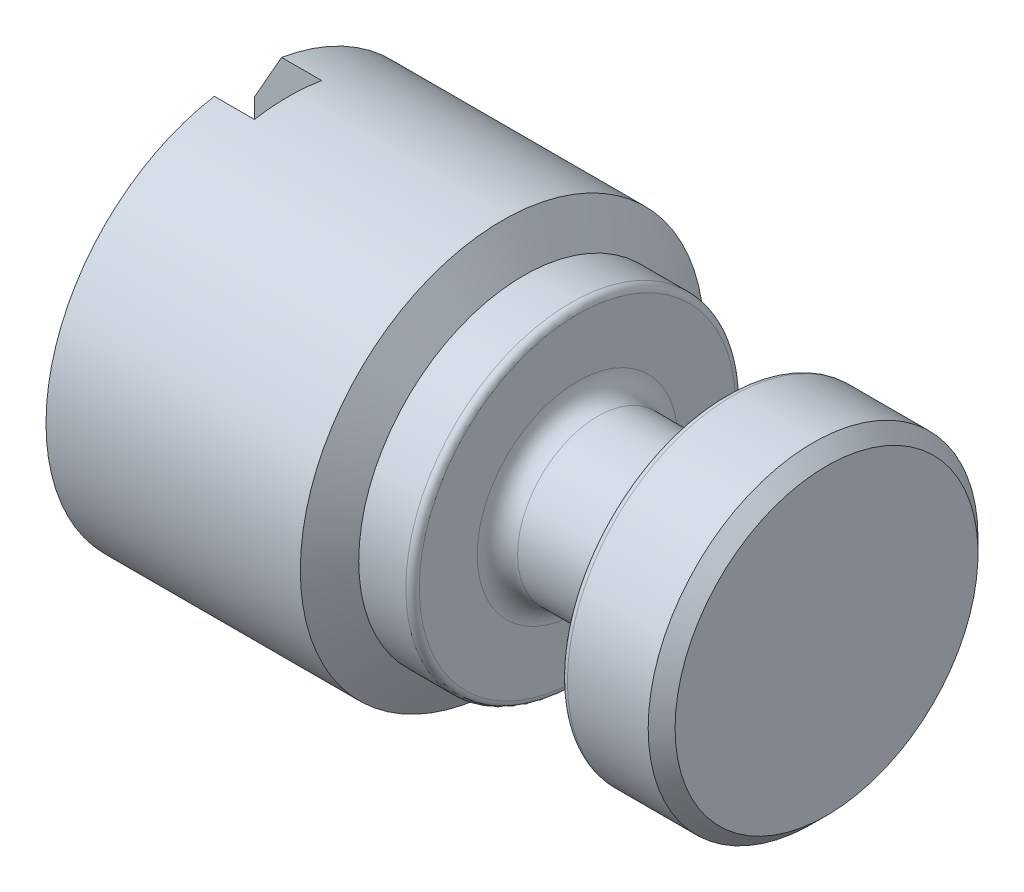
ISO-10303-21;
HEADER;
FILE_DESCRIPTION(('STEP AP214'),'2;1');
FILE_NAME('part.step','',(''),(''),'','','');
FILE_SCHEMA(('AUTOMOTIVE_DESIGN { 1 0 10303 214 1 1 1 1 }'));
ENDSEC;
DATA;
#1=APPLICATION_CONTEXT('core data for automotive mechanical design processes');
#2=APPLICATION_PROTOCOL_DEFINITION('international standard','automotive_design',2000,#1);
#3=PRODUCT_CONTEXT('',#1,'mechanical');
#4=PRODUCT('Part','Part','',(#3));
#5=PRODUCT_RELATED_PRODUCT_CATEGORY('part','',(#4));
#6=PRODUCT_DEFINITION_FORMATION('','',#4);
#7=PRODUCT_DEFINITION_CONTEXT('part definition',#1,'design');
#8=PRODUCT_DEFINITION('design','',#6,#7);
#9=PRODUCT_DEFINITION_SHAPE('','',#8);
#10=(LENGTH_UNIT() NAMED_UNIT(*) SI_UNIT(.MILLI.,.METRE.));
#11=(NAMED_UNIT(*) PLANE_ANGLE_UNIT() SI_UNIT($,.RADIAN.));
#12=(NAMED_UNIT(*) SI_UNIT($,.STERADIAN.) SOLID_ANGLE_UNIT());
#13=UNCERTAINTY_MEASURE_WITH_UNIT(LENGTH_MEASURE(1.E-05),#10,'distance_accuracy_value','');
#14=(GEOMETRIC_REPRESENTATION_CONTEXT(3) GLOBAL_UNCERTAINTY_ASSIGNED_CONTEXT((#13)) GLOBAL_UNIT_ASSIGNED_CONTEXT((#10,
#11,#12)) REPRESENTATION_CONTEXT('',''));
#15=CARTESIAN_POINT('',(0.,0.,0.));
#16=DIRECTION('',(0.,0.,1.));
#17=DIRECTION('',(1.,0.,0.));
#18=AXIS2_PLACEMENT_3D('',#15,#16,#17);
#19=CARTESIAN_POINT('',(0.40414518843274,0.,0.));
#20=DIRECTION('',(1.,0.,0.));
#21=DIRECTION('',(0.,0.,-1.));
#22=AXIS2_PLACEMENT_3D('',#19,#20,#21);
#23=CONICAL_SURFACE('',#22,3.,1.0471975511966);
#24=CARTESIAN_POINT('',(0.40414518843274,0.,0.));
#25=DIRECTION('',(-1.,0.,0.));
#26=DIRECTION('',(0.,0.,1.));
#27=AXIS2_PLACEMENT_3D('',#24,#25,#26);
#28=CIRCLE('',#27,3.);
#29=CARTESIAN_POINT('',(0.40414518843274,2.95803989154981,-0.499999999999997));
#30=VERTEX_POINT('',#29);
#31=CARTESIAN_POINT('',(0.40414518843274,-2.95803989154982,-0.500000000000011));
#32=VERTEX_POINT('',#31);
#33=EDGE_CURVE('E143',#30,#32,#28,.T.);
#34=ORIENTED_EDGE('',*,*,#33,.T.);
#35=CARTESIAN_POINT('',(2.4983365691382,-6.60835742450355,-0.499999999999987));
#36=CARTESIAN_POINT('',(2.33754994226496,-6.32905650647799,-0.499999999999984));
#37=CARTESIAN_POINT('',(2.17679546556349,-6.0497370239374,-0.499999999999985));
#38=CARTESIAN_POINT('',(1.85541884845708,-5.49101933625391,-0.499999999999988));
#39=CARTESIAN_POINT('',(1.69479670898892,-5.21162113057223,-0.49999999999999));
#40=CARTESIAN_POINT('',(1.37362738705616,-4.65248605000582,-0.499999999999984));
#41=CARTESIAN_POINT('',(1.21308036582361,-4.37274908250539,-0.499999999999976));
#42=CARTESIAN_POINT('',(0.892332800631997,-3.81307851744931,-0.499999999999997));
#43=CARTESIAN_POINT('',(0.732132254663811,-3.53314492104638,-0.500000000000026));
#44=CARTESIAN_POINT('',(0.492929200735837,-3.11396046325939,-0.500000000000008));
#45=CARTESIAN_POINT('',(0.413665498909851,-2.97485868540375,-0.499999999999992));
#46=CARTESIAN_POINT('',(0.255397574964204,-2.69650513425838,-0.499999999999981));
#47=CARTESIAN_POINT('',(0.176393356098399,-2.55725335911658,-0.499999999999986));
#48=CARTESIAN_POINT('',(0.0188328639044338,-2.27857581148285,-0.499999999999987));
#49=CARTESIAN_POINT('',(-0.0597235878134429,-2.13915013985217,-0.499999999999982));
#50=CARTESIAN_POINT('',(-0.216137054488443,-1.85991156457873,-0.499999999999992));
#51=CARTESIAN_POINT('',(-0.293994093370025,-1.72009867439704,-0.500000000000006));
#52=CARTESIAN_POINT('',(-0.409961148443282,-1.50940543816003,-0.499999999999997));
#53=CARTESIAN_POINT('',(-0.448588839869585,-1.43881034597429,-0.499999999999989));
#54=CARTESIAN_POINT('',(-0.525315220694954,-1.29732475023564,-0.499999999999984));
#55=CARTESIAN_POINT('',(-0.563413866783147,-1.22643422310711,-0.499999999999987));
#56=CARTESIAN_POINT('',(-0.638817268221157,-1.08412531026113,-0.499999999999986));
#57=CARTESIAN_POINT('',(-0.676121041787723,-1.0127064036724,-0.499999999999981));
#58=CARTESIAN_POINT('',(-0.749323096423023,-0.869156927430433,-0.499999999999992));
#59=CARTESIAN_POINT('',(-0.785221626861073,-0.797026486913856,-0.500000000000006));
#60=CARTESIAN_POINT('',(-0.837549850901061,-0.686867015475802,-0.499999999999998));
#61=CARTESIAN_POINT('',(-0.854960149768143,-0.64930666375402,-0.499999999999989));
#62=CARTESIAN_POINT('',(-0.888745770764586,-0.573725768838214,-0.499999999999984));
#63=CARTESIAN_POINT('',(-0.905121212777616,-0.535705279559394,-0.499999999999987));
#64=CARTESIAN_POINT('',(-0.936339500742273,-0.459031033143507,-0.499999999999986));
#65=CARTESIAN_POINT('',(-0.951182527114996,-0.420377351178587,-0.499999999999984));
#66=CARTESIAN_POINT('',(-0.978536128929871,-0.342270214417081,-0.49999999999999));
#67=CARTESIAN_POINT('',(-0.991047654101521,-0.302817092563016,-0.499999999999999));
#68=CARTESIAN_POINT('',(-1.01648208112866,-0.208025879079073,-0.500000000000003));
#69=CARTESIAN_POINT('',(-1.02784152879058,-0.152215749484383,-0.499999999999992));
#70=CARTESIAN_POINT('',(-1.03702258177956,-0.0678306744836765,-0.499999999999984));
#71=CARTESIAN_POINT('',(-1.03878028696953,-0.0396852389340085,-0.499999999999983));
#72=CARTESIAN_POINT('',(-1.03952744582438,0.0166440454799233,-0.49999999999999));
#73=CARTESIAN_POINT('',(-1.03851695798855,0.0448278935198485,-0.499999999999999));
#74=CARTESIAN_POINT('',(-1.03321049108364,0.108525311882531,-0.500000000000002));
#75=CARTESIAN_POINT('',(-1.02810354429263,0.14397033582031,-0.49999999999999));
#76=CARTESIAN_POINT('',(-1.01444226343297,0.214196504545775,-0.499999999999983));
#77=CARTESIAN_POINT('',(-1.00588391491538,0.248976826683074,-0.499999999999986));
#78=CARTESIAN_POINT('',(-0.986157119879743,0.318273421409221,-0.499999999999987));
#79=CARTESIAN_POINT('',(-0.974955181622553,0.352779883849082,-0.499999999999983));
#80=CARTESIAN_POINT('',(-0.950795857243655,0.421147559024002,-0.49999999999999));
#81=CARTESIAN_POINT('',(-0.937839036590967,0.455008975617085,-0.5));
#82=CARTESIAN_POINT('',(-0.909399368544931,0.525488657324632,-0.500000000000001));
#83=CARTESIAN_POINT('',(-0.893793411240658,0.562056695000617,-0.499999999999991));
#84=CARTESIAN_POINT('',(-0.861582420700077,0.634752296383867,-0.499999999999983));
#85=CARTESIAN_POINT('',(-0.844977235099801,0.670879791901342,-0.499999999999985));
#86=CARTESIAN_POINT('',(-0.794117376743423,0.778807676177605,-0.499999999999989));
#87=CARTESIAN_POINT('',(-0.758832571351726,0.850120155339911,-0.499999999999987));
#88=CARTESIAN_POINT('',(-0.686767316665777,0.992116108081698,-0.499999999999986));
#89=CARTESIAN_POINT('',(-0.649984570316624,1.06279839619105,-0.499999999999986));
#90=CARTESIAN_POINT('',(-0.57556503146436,1.20368457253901,-0.499999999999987));
#91=CARTESIAN_POINT('',(-0.537928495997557,1.27388859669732,-0.499999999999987));
#92=CARTESIAN_POINT('',(-0.462314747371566,1.41362256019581,-0.499999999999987));
#93=CARTESIAN_POINT('',(-0.424340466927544,1.48315409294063,-0.499999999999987));
#94=CARTESIAN_POINT('',(-0.348023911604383,1.62202162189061,-0.499999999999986));
#95=CARTESIAN_POINT('',(-0.309681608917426,1.69135760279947,-0.499999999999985));
#96=CARTESIAN_POINT('',(-0.194352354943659,1.8990197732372,-0.499999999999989));
#97=CARTESIAN_POINT('',(-0.116988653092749,2.03713648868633,-0.499999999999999));
#98=CARTESIAN_POINT('',(0.064775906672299,2.3601671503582,-0.500000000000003));
#99=CARTESIAN_POINT('',(0.169390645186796,2.54496043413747,-0.499999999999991));
#100=CARTESIAN_POINT('',(0.379124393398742,2.91426301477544,-0.499999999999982));
#101=CARTESIAN_POINT('',(0.484243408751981,3.09877230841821,-0.499999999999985));
#102=CARTESIAN_POINT('',(0.800118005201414,3.65220737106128,-0.49999999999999));
#103=CARTESIAN_POINT('',(1.01130433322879,4.02088713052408,-0.499999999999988));
#104=CARTESIAN_POINT('',(1.43503208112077,4.75953035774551,-0.499999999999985));
#105=CARTESIAN_POINT('',(1.647575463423,5.12949269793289,-0.499999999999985));
#106=CARTESIAN_POINT('',(2.07284454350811,5.86909697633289,-0.499999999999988));
#107=CARTESIAN_POINT('',(2.28557012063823,6.23873898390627,-0.499999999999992));
#108=CARTESIAN_POINT('',(2.49833656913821,6.60835742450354,-0.5));
#109=B_SPLINE_CURVE_WITH_KNOTS('',3,(#35,#36,#37,#38,#39,#40,#41,#42,#43,#44,#45,#46,#47,#48,
#49,#50,#51,#52,#53,#54,#55,#56,#57,#58,#59,#60,#61,#62,#63,#64,#65,#66,#67,#68,#69,#70,#71,#72,
#73,#74,#75,#76,#77,#78,#79,#80,#81,#82,#83,#84,#85,#86,#87,#88,#89,#90,#91,#92,#93,#94,#95,#96,
#97,#98,#99,#100,#101,#102,#103,#104,#105,#106,#107,#108),.UNSPECIFIED.,.F.,.F.,(4,2,2,2,2,2,2,
2,2,2,2,2,2,2,2,2,2,2,2,2,2,2,2,2,2,2,2,2,2,2,2,2,2,2,2,2,4),(0.,0.966825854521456,
1.93365849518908,2.90126013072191,3.86885614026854,4.3491562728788,4.82946240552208,
5.30956152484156,5.7896441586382,6.03105935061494,6.27249419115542,6.51421172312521,
6.75588616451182,6.88007299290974,7.00424540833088,7.12840318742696,7.25251028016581,
7.42257675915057,7.50705075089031,7.59152295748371,7.69872713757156,7.80605637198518,
7.91482621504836,8.02356109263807,8.14281580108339,8.26208873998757,8.50074311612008,
8.73977836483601,8.97874258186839,9.21641780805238,9.45411113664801,9.92903195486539,
10.5660826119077,11.2031404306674,12.477784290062,13.7577926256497,15.0372402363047),.UNSPECIFIED.);
#110=CARTESIAN_POINT('',(0.,-2.24499443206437,-0.5));
#111=VERTEX_POINT('',#110);
#112=EDGE_CURVE('E86',#32,#111,#109,.T.);
#113=ORIENTED_EDGE('',*,*,#112,.T.);
#114=CARTESIAN_POINT('',(0.,0.,0.));
#115=DIRECTION('',(-1.,0.,0.));
#116=DIRECTION('',(0.,0.,1.));
#117=AXIS2_PLACEMENT_3D('',#114,#115,#116);
#118=CIRCLE('',#117,2.3);
#119=CARTESIAN_POINT('',(0.,2.24499443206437,-0.5));
#120=VERTEX_POINT('',#119);
#121=EDGE_CURVE('E135',#120,#111,#118,.T.);
#122=ORIENTED_EDGE('',*,*,#121,.F.);
#123=EDGE_CURVE('E284',#120,#30,#109,.T.);
#124=ORIENTED_EDGE('',*,*,#123,.T.);
#125=EDGE_LOOP('',(#34,#113,#122,#124));
#126=FACE_BOUND('',#125,.T.);
#127=ADVANCED_FACE('F63',(#126),#23,.T.);
#128=CARTESIAN_POINT('',(0.,2.3,0.));
#129=DIRECTION('',(1.,0.,0.));
#130=DIRECTION('',(0.,0.,-1.));
#131=AXIS2_PLACEMENT_3D('',#128,#129,#130);
#132=PLANE('',#131);
#133=ORIENTED_EDGE('',*,*,#121,.T.);
#134=DIRECTION('',(0.,1.,0.));
#135=VECTOR('',#134,1.);
#136=CARTESIAN_POINT('',(0.,2.3,-0.5));
#137=LINE('',#136,#135);
#138=EDGE_CURVE('E122',#111,#120,#137,.T.);
#139=ORIENTED_EDGE('',*,*,#138,.T.);
#140=EDGE_LOOP('',(#133,#139));
#141=FACE_BOUND('',#140,.T.);
#142=ADVANCED_FACE('F193',(#141),#132,.F.);
#143=CARTESIAN_POINT('',(9.,0.,0.));
#144=DIRECTION('',(-1.,0.,0.));
#145=DIRECTION('',(0.,0.,1.));
#146=AXIS2_PLACEMENT_3D('',#143,#144,#145);
#147=PLANE('',#146);
#148=CARTESIAN_POINT('',(9.,0.,0.));
#149=DIRECTION('',(-1.,0.,0.));
#150=DIRECTION('',(0.,0.,1.));
#151=AXIS2_PLACEMENT_3D('',#148,#149,#150);
#152=CIRCLE('',#151,2.25);
#153=CARTESIAN_POINT('',(9.,0.,2.25));
#154=VERTEX_POINT('',#153);
#155=EDGE_CURVE('E153',#154,#154,#152,.F.);
#156=ORIENTED_EDGE('',*,*,#155,.T.);
#157=EDGE_LOOP('',(#156));
#158=FACE_BOUND('',#157,.T.);
#159=ADVANCED_FACE('F199',(#158),#147,.F.);
#160=CARTESIAN_POINT('',(-5.4550241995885,0.,0.));
#161=DIRECTION('',(-1.,0.,0.));
#162=DIRECTION('',(0.,0.,1.));
#163=AXIS2_PLACEMENT_3D('',#160,#161,#162);
#164=CYLINDRICAL_SURFACE('',#163,2.45);
#165=CARTESIAN_POINT('',(7.6,0.,0.));
#166=DIRECTION('',(1.,0.,0.));
#167=DIRECTION('',(0.,0.,-1.));
#168=AXIS2_PLACEMENT_3D('',#165,#166,#167);
#169=CIRCLE('',#168,2.45);
#170=CARTESIAN_POINT('',(7.6,0.,-2.45));
#171=VERTEX_POINT('',#170);
#172=EDGE_CURVE('E12',#171,#171,#169,.T.);
#173=ORIENTED_EDGE('',*,*,#172,.T.);
#174=EDGE_LOOP('',(#173));
#175=FACE_BOUND('',#174,.T.);
#176=CARTESIAN_POINT('',(8.8,0.,0.));
#177=DIRECTION('',(-1.,0.,0.));
#178=DIRECTION('',(0.,0.,1.));
#179=AXIS2_PLACEMENT_3D('',#176,#177,#178);
#180=CIRCLE('',#179,2.45);
#181=CARTESIAN_POINT('',(8.8,0.,2.45000000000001));
#182=VERTEX_POINT('',#181);
#183=EDGE_CURVE('E150',#182,#182,#180,.T.);
#184=ORIENTED_EDGE('',*,*,#183,.T.);
#185=EDGE_LOOP('',(#184));
#186=FACE_BOUND('',#185,.T.);
#187=ADVANCED_FACE('F236',(#175,#186),#164,.T.);
#188=CARTESIAN_POINT('',(7.50000000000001,2.45000000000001,0.));
#189=DIRECTION('',(1.,0.,0.));
#190=DIRECTION('',(0.,0.,-1.));
#191=AXIS2_PLACEMENT_3D('',#188,#189,#190);
#192=PLANE('',#191);
#193=CARTESIAN_POINT('',(7.5,0.,0.));
#194=DIRECTION('',(1.,0.,0.));
#195=DIRECTION('',(0.,0.,-1.));
#196=AXIS2_PLACEMENT_3D('',#193,#194,#195);
#197=CIRCLE('',#196,2.35);
#198=CARTESIAN_POINT('',(7.5,0.,-2.35));
#199=VERTEX_POINT('',#198);
#200=EDGE_CURVE('E71',#199,#199,#197,.F.);
#201=ORIENTED_EDGE('',*,*,#200,.T.);
#202=EDGE_LOOP('',(#201));
#203=FACE_BOUND('',#202,.T.);
#204=CARTESIAN_POINT('',(7.5,0.,0.));
#205=DIRECTION('',(1.,0.,0.));
#206=DIRECTION('',(0.,0.,-1.));
#207=AXIS2_PLACEMENT_3D('',#204,#205,#206);
#208=CIRCLE('',#207,1.49);
#209=CARTESIAN_POINT('',(7.5,0.,-1.49));
#210=VERTEX_POINT('',#209);
#211=EDGE_CURVE('E123',#210,#210,#208,.T.);
#212=ORIENTED_EDGE('',*,*,#211,.T.);
#213=EDGE_LOOP('',(#212));
#214=FACE_BOUND('',#213,.T.);
#215=ADVANCED_FACE('F181',(#203,#214),#192,.F.);
#216=CARTESIAN_POINT('',(-5.4550241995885,0.,0.));
#217=DIRECTION('',(-1.,0.,0.));
#218=DIRECTION('',(0.,0.,1.));
#219=AXIS2_PLACEMENT_3D('',#216,#217,#218);
#220=CYLINDRICAL_SURFACE('',#219,1.19);
#221=CARTESIAN_POINT('',(5.6,0.,0.));
#222=DIRECTION('',(-1.,0.,0.));
#223=DIRECTION('',(0.,0.,1.));
#224=AXIS2_PLACEMENT_3D('',#221,#222,#223);
#225=CIRCLE('',#224,1.19);
#226=CARTESIAN_POINT('',(5.6,0.,1.19000000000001));
#227=VERTEX_POINT('',#226);
#228=EDGE_CURVE('E162',#227,#227,#225,.F.);
#229=ORIENTED_EDGE('',*,*,#228,.T.);
#230=EDGE_LOOP('',(#229));
#231=FACE_BOUND('',#230,.T.);
#232=CARTESIAN_POINT('',(7.2,0.,0.));
#233=DIRECTION('',(1.,0.,0.));
#234=DIRECTION('',(0.,0.,-1.));
#235=AXIS2_PLACEMENT_3D('',#232,#233,#234);
#236=CIRCLE('',#235,1.19);
#237=CARTESIAN_POINT('',(7.2,0.,-1.19));
#238=VERTEX_POINT('',#237);
#239=EDGE_CURVE('E159',#238,#238,#236,.F.);
#240=ORIENTED_EDGE('',*,*,#239,.T.);
#241=EDGE_LOOP('',(#240));
#242=FACE_BOUND('',#241,.T.);
#243=ADVANCED_FACE('F229',(#231,#242),#220,.T.);
#244=CARTESIAN_POINT('',(5.3,1.19,0.));
#245=DIRECTION('',(-1.,0.,0.));
#246=DIRECTION('',(0.,0.,1.));
#247=AXIS2_PLACEMENT_3D('',#244,#245,#246);
#248=PLANE('',#247);
#249=CARTESIAN_POINT('',(5.3,0.,0.));
#250=DIRECTION('',(-1.,0.,0.));
#251=DIRECTION('',(0.,0.,1.));
#252=AXIS2_PLACEMENT_3D('',#249,#250,#251);
#253=CIRCLE('',#252,2.35);
#254=CARTESIAN_POINT('',(5.3,0.,2.35000000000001));
#255=VERTEX_POINT('',#254);
#256=EDGE_CURVE('E176',#255,#255,#253,.F.);
#257=ORIENTED_EDGE('',*,*,#256,.T.);
#258=EDGE_LOOP('',(#257));
#259=FACE_BOUND('',#258,.T.);
#260=CARTESIAN_POINT('',(5.3,0.,0.));
#261=DIRECTION('',(-1.,0.,0.));
#262=DIRECTION('',(0.,0.,1.));
#263=AXIS2_PLACEMENT_3D('',#260,#261,#262);
#264=CIRCLE('',#263,1.49);
#265=CARTESIAN_POINT('',(5.3,0.,1.49000000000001));
#266=VERTEX_POINT('',#265);
#267=EDGE_CURVE('E156',#266,#266,#264,.T.);
#268=ORIENTED_EDGE('',*,*,#267,.T.);
#269=EDGE_LOOP('',(#268));
#270=FACE_BOUND('',#269,.T.);
#271=ADVANCED_FACE('F225',(#259,#270),#248,.F.);
#272=CARTESIAN_POINT('',(-5.4550241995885,0.,0.));
#273=DIRECTION('',(-1.,0.,0.));
#274=DIRECTION('',(0.,0.,1.));
#275=AXIS2_PLACEMENT_3D('',#272,#273,#274);
#276=CYLINDRICAL_SURFACE('',#275,2.45);
#277=CARTESIAN_POINT('',(5.2,0.,0.));
#278=DIRECTION('',(-1.,0.,0.));
#279=DIRECTION('',(0.,0.,1.));
#280=AXIS2_PLACEMENT_3D('',#277,#278,#279);
#281=CIRCLE('',#280,2.45);
#282=CARTESIAN_POINT('',(5.2,0.,2.45000000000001));
#283=VERTEX_POINT('',#282);
#284=EDGE_CURVE('E173',#283,#283,#281,.T.);
#285=ORIENTED_EDGE('',*,*,#284,.T.);
#286=EDGE_LOOP('',(#285));
#287=FACE_BOUND('',#286,.T.);
#288=CARTESIAN_POINT('',(4.5,0.,0.));
#289=DIRECTION('',(-1.,0.,0.));
#290=DIRECTION('',(0.,0.,1.));
#291=AXIS2_PLACEMENT_3D('',#288,#289,#290);
#292=CIRCLE('',#291,2.45);
#293=CARTESIAN_POINT('',(4.5,0.,2.45000000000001));
#294=VERTEX_POINT('',#293);
#295=EDGE_CURVE('E147',#294,#294,#292,.T.);
#296=ORIENTED_EDGE('',*,*,#295,.F.);
#297=EDGE_LOOP('',(#296));
#298=FACE_BOUND('',#297,.T.);
#299=ADVANCED_FACE('F217',(#287,#298),#276,.T.);
#300=CARTESIAN_POINT('',(4.5,0.,0.));
#301=DIRECTION('',(-1.,0.,0.));
#302=DIRECTION('',(0.,0.,1.));
#303=AXIS2_PLACEMENT_3D('',#300,#301,#302);
#304=CONICAL_SURFACE('',#303,2.45,1.0471975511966);
#305=CARTESIAN_POINT('',(4.18245735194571,0.,0.));
#306=DIRECTION('',(-1.,0.,0.));
#307=DIRECTION('',(0.,0.,1.));
#308=AXIS2_PLACEMENT_3D('',#305,#306,#307);
#309=CIRCLE('',#308,3.);
#310=CARTESIAN_POINT('',(4.18245735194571,0.,3.00000000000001));
#311=VERTEX_POINT('',#310);
#312=EDGE_CURVE('E144',#311,#311,#309,.T.);
#313=ORIENTED_EDGE('',*,*,#312,.F.);
#314=EDGE_LOOP('',(#313));
#315=FACE_BOUND('',#314,.T.);
#316=ORIENTED_EDGE('',*,*,#295,.T.);
#317=EDGE_LOOP('',(#316));
#318=FACE_BOUND('',#317,.T.);
#319=ADVANCED_FACE('F212',(#315,#318),#304,.T.);
#320=CARTESIAN_POINT('',(-5.4550241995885,0.,0.));
#321=DIRECTION('',(-1.,0.,0.));
#322=DIRECTION('',(0.,0.,1.));
#323=AXIS2_PLACEMENT_3D('',#320,#321,#322);
#324=CYLINDRICAL_SURFACE('',#323,3.);
#325=ORIENTED_EDGE('',*,*,#33,.F.);
#326=DIRECTION('',(-1.,0.,0.));
#327=VECTOR('',#326,1.);
#328=CARTESIAN_POINT('',(-5.4550241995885,2.95803989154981,-0.499999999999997));
#329=LINE('',#328,#327);
#330=CARTESIAN_POINT('',(1.,2.95803989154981,-0.499999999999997));
#331=VERTEX_POINT('',#330);
#332=EDGE_CURVE('E289',#30,#331,#329,.F.);
#333=ORIENTED_EDGE('',*,*,#332,.T.);
#334=CARTESIAN_POINT('',(1.,0.,0.));
#335=DIRECTION('',(1.,0.,0.));
#336=DIRECTION('',(0.,0.,-1.));
#337=AXIS2_PLACEMENT_3D('',#334,#335,#336);
#338=CIRCLE('',#337,3.);
#339=CARTESIAN_POINT('',(1.,2.95803989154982,0.500000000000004));
#340=VERTEX_POINT('',#339);
#341=EDGE_CURVE('E172',#331,#340,#338,.T.);
#342=ORIENTED_EDGE('',*,*,#341,.T.);
#343=DIRECTION('',(-1.,0.,0.));
#344=VECTOR('',#343,1.);
#345=CARTESIAN_POINT('',(-5.4550241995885,2.95803989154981,0.500000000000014));
#346=LINE('',#345,#344);
#347=CARTESIAN_POINT('',(0.40414518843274,2.95803989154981,0.5));
#348=VERTEX_POINT('',#347);
#349=EDGE_CURVE('E131',#340,#348,#346,.T.);
#350=ORIENTED_EDGE('',*,*,#349,.T.);
#351=CARTESIAN_POINT('',(0.40414518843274,-2.95803989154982,0.500000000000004));
#352=VERTEX_POINT('',#351);
#353=EDGE_CURVE('E130',#352,#348,#28,.T.);
#354=ORIENTED_EDGE('',*,*,#353,.F.);
#355=DIRECTION('',(-1.,0.,0.));
#356=VECTOR('',#355,1.);
#357=CARTESIAN_POINT('',(-5.4550241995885,-2.95803989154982,0.500000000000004));
#358=LINE('',#357,#356);
#359=CARTESIAN_POINT('',(1.,-2.95803989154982,0.500000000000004));
#360=VERTEX_POINT('',#359);
#361=EDGE_CURVE('E132',#352,#360,#358,.F.);
#362=ORIENTED_EDGE('',*,*,#361,.T.);
#363=CARTESIAN_POINT('',(1.,-2.95803989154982,-0.500000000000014));
#364=VERTEX_POINT('',#363);
#365=EDGE_CURVE('E169',#360,#364,#338,.T.);
#366=ORIENTED_EDGE('',*,*,#365,.T.);
#367=DIRECTION('',(-1.,0.,0.));
#368=VECTOR('',#367,1.);
#369=CARTESIAN_POINT('',(-5.4550241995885,-2.95803989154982,-0.500000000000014));
#370=LINE('',#369,#368);
#371=EDGE_CURVE('E136',#364,#32,#370,.T.);
#372=ORIENTED_EDGE('',*,*,#371,.T.);
#373=EDGE_LOOP('',(#325,#333,#342,#350,#354,#362,#366,#372));
#374=FACE_BOUND('',#373,.T.);
#375=ORIENTED_EDGE('',*,*,#312,.T.);
#376=EDGE_LOOP('',(#375));
#377=FACE_BOUND('',#376,.T.);
#378=ADVANCED_FACE('F206',(#374,#377),#324,.T.);
#379=ORIENTED_EDGE('',*,*,#353,.T.);
#380=CARTESIAN_POINT('',(2.4983365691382,6.60835742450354,0.5));
#381=CARTESIAN_POINT('',(2.33754994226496,6.32905650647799,0.500000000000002));
#382=CARTESIAN_POINT('',(2.17679546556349,6.04973702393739,0.500000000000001));
#383=CARTESIAN_POINT('',(1.85541884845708,5.49101933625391,0.5));
#384=CARTESIAN_POINT('',(1.69479670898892,5.21162113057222,0.499999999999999));
#385=CARTESIAN_POINT('',(1.37362738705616,4.65248605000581,0.500000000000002));
#386=CARTESIAN_POINT('',(1.21308036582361,4.37274908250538,0.500000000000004));
#387=CARTESIAN_POINT('',(0.892332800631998,3.8130785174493,0.499999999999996));
#388=CARTESIAN_POINT('',(0.732132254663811,3.53314492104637,0.499999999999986));
#389=CARTESIAN_POINT('',(0.492929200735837,3.11396046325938,0.499999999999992));
#390=CARTESIAN_POINT('',(0.413665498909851,2.97485868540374,0.499999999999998));
#391=CARTESIAN_POINT('',(0.255397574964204,2.69650513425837,0.500000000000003));
#392=CARTESIAN_POINT('',(0.176393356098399,2.55725335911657,0.500000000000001));
#393=CARTESIAN_POINT('',(0.0188328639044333,2.27857581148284,0.5));
#394=CARTESIAN_POINT('',(-0.0597235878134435,2.13915013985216,0.5));
#395=CARTESIAN_POINT('',(-0.216137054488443,1.85991156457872,0.500000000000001));
#396=CARTESIAN_POINT('',(-0.293994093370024,1.72009867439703,0.5));
#397=CARTESIAN_POINT('',(-0.409961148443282,1.50940543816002,0.5));
#398=CARTESIAN_POINT('',(-0.448588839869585,1.43881034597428,0.5));
#399=CARTESIAN_POINT('',(-0.525315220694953,1.29732475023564,0.5));
#400=CARTESIAN_POINT('',(-0.563413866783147,1.2264342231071,0.5));
#401=CARTESIAN_POINT('',(-0.638817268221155,1.08412531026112,0.5));
#402=CARTESIAN_POINT('',(-0.67612104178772,1.01270640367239,0.5));
#403=CARTESIAN_POINT('',(-0.749323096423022,0.869156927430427,0.5));
#404=CARTESIAN_POINT('',(-0.785221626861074,0.797026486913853,0.500000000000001));
#405=CARTESIAN_POINT('',(-0.83754985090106,0.686867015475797,0.5));
#406=CARTESIAN_POINT('',(-0.85496014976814,0.649306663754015,0.5));
#407=CARTESIAN_POINT('',(-0.888745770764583,0.573725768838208,0.500000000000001));
#408=CARTESIAN_POINT('',(-0.905121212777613,0.535705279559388,0.500000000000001));
#409=CARTESIAN_POINT('',(-0.936339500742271,0.4590310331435,0.5));
#410=CARTESIAN_POINT('',(-0.951182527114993,0.420377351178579,0.499999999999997));
#411=CARTESIAN_POINT('',(-0.978536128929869,0.342270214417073,0.500000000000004));
#412=CARTESIAN_POINT('',(-0.99104765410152,0.302817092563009,0.500000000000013));
#413=CARTESIAN_POINT('',(-1.01648208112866,0.208025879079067,0.500000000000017));
#414=CARTESIAN_POINT('',(-1.02784152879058,0.152215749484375,0.500000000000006));
#415=CARTESIAN_POINT('',(-1.03702258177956,0.067830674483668,0.499999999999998));
#416=CARTESIAN_POINT('',(-1.03878028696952,0.039685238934,0.499999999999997));
#417=CARTESIAN_POINT('',(-1.03952744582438,-0.0166440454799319,0.500000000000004));
#418=CARTESIAN_POINT('',(-1.03851695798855,-0.0448278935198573,0.500000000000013));
#419=CARTESIAN_POINT('',(-1.03321049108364,-0.108525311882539,0.500000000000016));
#420=CARTESIAN_POINT('',(-1.02810354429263,-0.143970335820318,0.500000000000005));
#421=CARTESIAN_POINT('',(-1.01444226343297,-0.214196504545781,0.499999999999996));
#422=CARTESIAN_POINT('',(-1.00588391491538,-0.24897682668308,0.499999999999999));
#423=CARTESIAN_POINT('',(-0.986157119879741,-0.318273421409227,0.500000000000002));
#424=CARTESIAN_POINT('',(-0.97495518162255,-0.352779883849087,0.500000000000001));
#425=CARTESIAN_POINT('',(-0.950795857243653,-0.421147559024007,0.5));
#426=CARTESIAN_POINT('',(-0.937839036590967,-0.45500897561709,0.5));
#427=CARTESIAN_POINT('',(-0.909399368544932,-0.525488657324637,0.500000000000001));
#428=CARTESIAN_POINT('',(-0.893793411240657,-0.562056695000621,0.5));
#429=CARTESIAN_POINT('',(-0.861582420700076,-0.634752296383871,0.5));
#430=CARTESIAN_POINT('',(-0.8449772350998,-0.670879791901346,0.5));
#431=CARTESIAN_POINT('',(-0.794117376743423,-0.778807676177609,0.5));
#432=CARTESIAN_POINT('',(-0.758832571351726,-0.850120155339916,0.5));
#433=CARTESIAN_POINT('',(-0.686767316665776,-0.992116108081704,0.5));
#434=CARTESIAN_POINT('',(-0.649984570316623,-1.06279839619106,0.5));
#435=CARTESIAN_POINT('',(-0.575565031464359,-1.20368457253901,0.5));
#436=CARTESIAN_POINT('',(-0.537928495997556,-1.27388859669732,0.5));
#437=CARTESIAN_POINT('',(-0.462314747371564,-1.41362256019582,0.500000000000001));
#438=CARTESIAN_POINT('',(-0.424340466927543,-1.48315409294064,0.500000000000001));
#439=CARTESIAN_POINT('',(-0.348023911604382,-1.62202162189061,0.5));
#440=CARTESIAN_POINT('',(-0.309681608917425,-1.69135760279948,0.499999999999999));
#441=CARTESIAN_POINT('',(-0.194352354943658,-1.89901977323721,0.500000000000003));
#442=CARTESIAN_POINT('',(-0.116988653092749,-2.03713648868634,0.500000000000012));
#443=CARTESIAN_POINT('',(0.0647759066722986,-2.36016715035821,0.500000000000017));
#444=CARTESIAN_POINT('',(0.169390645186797,-2.54496043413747,0.500000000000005));
#445=CARTESIAN_POINT('',(0.379124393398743,-2.91426301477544,0.499999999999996));
#446=CARTESIAN_POINT('',(0.484243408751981,-3.09877230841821,0.499999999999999));
#447=CARTESIAN_POINT('',(0.800118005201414,-3.65220737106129,0.500000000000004));
#448=CARTESIAN_POINT('',(1.01130433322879,-4.02088713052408,0.500000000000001));
#449=CARTESIAN_POINT('',(1.43503208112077,-4.75953035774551,0.499999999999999));
#450=CARTESIAN_POINT('',(1.647575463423,-5.1294926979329,0.5));
#451=CARTESIAN_POINT('',(2.07284454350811,-5.86909697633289,0.500000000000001));
#452=CARTESIAN_POINT('',(2.28557012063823,-6.23873898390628,0.500000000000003));
#453=CARTESIAN_POINT('',(2.4983365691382,-6.60835742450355,0.500000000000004));
#454=B_SPLINE_CURVE_WITH_KNOTS('',3,(#380,#381,#382,#383,#384,#385,#386,#387,#388,#389,#390,
#391,#392,#393,#394,#395,#396,#397,#398,#399,#400,#401,#402,#403,#404,#405,#406,#407,#408,#409,
#410,#411,#412,#413,#414,#415,#416,#417,#418,#419,#420,#421,#422,#423,#424,#425,#426,#427,#428,
#429,#430,#431,#432,#433,#434,#435,#436,#437,#438,#439,#440,#441,#442,#443,#444,#445,#446,#447,
#448,#449,#450,#451,#452,#453),.UNSPECIFIED.,.F.,.F.,(4,2,2,2,2,2,2,2,2,2,2,2,2,2,2,2,2,2,2,2,2,
2,2,2,2,2,2,2,2,2,2,2,2,2,2,2,4),(0.,0.966825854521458,1.93365849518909,2.90126013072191,
3.86885614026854,4.34915627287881,4.82946240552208,5.30956152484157,5.7896441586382,
6.03105935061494,6.27249419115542,6.51421172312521,6.75588616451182,6.88007299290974,
7.00424540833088,7.12840318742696,7.25251028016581,7.42257675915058,7.50705075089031,
7.59152295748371,7.69872713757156,7.80605637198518,7.91482621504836,8.02356109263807,
8.14281580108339,8.26208873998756,8.50074311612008,8.73977836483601,8.97874258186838,
9.21641780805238,9.45411113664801,9.92903195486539,10.5660826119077,11.2031404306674,
12.477784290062,13.7577926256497,15.0372402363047),.UNSPECIFIED.);
#455=CARTESIAN_POINT('',(0.,2.24499443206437,0.5));
#456=VERTEX_POINT('',#455);
#457=EDGE_CURVE('E117',#348,#456,#454,.T.);
#458=ORIENTED_EDGE('',*,*,#457,.T.);
#459=CARTESIAN_POINT('',(0.,-2.24499443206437,0.500000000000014));
#460=VERTEX_POINT('',#459);
#461=EDGE_CURVE('E128',#460,#456,#118,.T.);
#462=ORIENTED_EDGE('',*,*,#461,.F.);
#463=EDGE_CURVE('E78',#460,#352,#454,.T.);
#464=ORIENTED_EDGE('',*,*,#463,.T.);
#465=EDGE_LOOP('',(#379,#458,#462,#464));
#466=FACE_BOUND('',#465,.T.);
#467=ADVANCED_FACE('F127',(#466),#23,.T.);
#468=ORIENTED_EDGE('',*,*,#461,.T.);
#469=DIRECTION('',(0.,-1.,0.));
#470=VECTOR('',#469,1.);
#471=CARTESIAN_POINT('',(0.,2.3,0.5));
#472=LINE('',#471,#470);
#473=EDGE_CURVE('E113',#456,#460,#472,.T.);
#474=ORIENTED_EDGE('',*,*,#473,.T.);
#475=EDGE_LOOP('',(#468,#474));
#476=FACE_BOUND('',#475,.T.);
#477=ADVANCED_FACE('F134',(#476),#132,.F.);
#478=CARTESIAN_POINT('',(8.8,0.,0.));
#479=DIRECTION('',(-1.,0.,0.));
#480=DIRECTION('',(0.,0.,1.));
#481=AXIS2_PLACEMENT_3D('',#478,#479,#480);
#482=CONICAL_SURFACE('',#481,2.45,0.78539816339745);
#483=ORIENTED_EDGE('',*,*,#155,.F.);
#484=EDGE_LOOP('',(#483));
#485=FACE_BOUND('',#484,.T.);
#486=ORIENTED_EDGE('',*,*,#183,.F.);
#487=EDGE_LOOP('',(#486));
#488=FACE_BOUND('',#487,.T.);
#489=ADVANCED_FACE('F211',(#485,#488),#482,.T.);
#490=CARTESIAN_POINT('',(5.6,0.,0.));
#491=DIRECTION('',(-1.,0.,0.));
#492=DIRECTION('',(0.,0.,1.));
#493=AXIS2_PLACEMENT_3D('',#490,#491,#492);
#494=TOROIDAL_SURFACE('',#493,1.49,0.3);
#495=ORIENTED_EDGE('',*,*,#228,.F.);
#496=EDGE_LOOP('',(#495));
#497=FACE_BOUND('',#496,.T.);
#498=ORIENTED_EDGE('',*,*,#267,.F.);
#499=EDGE_LOOP('',(#498));
#500=FACE_BOUND('',#499,.T.);
#501=ADVANCED_FACE('F245',(#497,#500),#494,.F.);
#502=CARTESIAN_POINT('',(7.2,0.,0.));
#503=DIRECTION('',(1.,0.,0.));
#504=DIRECTION('',(0.,0.,-1.));
#505=AXIS2_PLACEMENT_3D('',#502,#503,#504);
#506=TOROIDAL_SURFACE('',#505,1.49,0.3);
#507=ORIENTED_EDGE('',*,*,#211,.F.);
#508=EDGE_LOOP('',(#507));
#509=FACE_BOUND('',#508,.T.);
#510=ORIENTED_EDGE('',*,*,#239,.F.);
#511=EDGE_LOOP('',(#510));
#512=FACE_BOUND('',#511,.T.);
#513=ADVANCED_FACE('F249',(#509,#512),#506,.F.);
#514=CARTESIAN_POINT('',(1.,-4.5,-0.499999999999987));
#515=DIRECTION('',(1.,0.,0.));
#516=DIRECTION('',(0.,0.,-1.));
#517=AXIS2_PLACEMENT_3D('',#514,#515,#516);
#518=PLANE('',#517);
#519=DIRECTION('',(0.,1.,0.));
#520=VECTOR('',#519,1.);
#521=CARTESIAN_POINT('',(1.,-4.5,-0.499999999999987));
#522=LINE('',#521,#520);
#523=EDGE_CURVE('E278',#364,#331,#522,.T.);
#524=ORIENTED_EDGE('',*,*,#523,.F.);
#525=ORIENTED_EDGE('',*,*,#365,.F.);
#526=DIRECTION('',(0.,1.,0.));
#527=VECTOR('',#526,1.);
#528=CARTESIAN_POINT('',(1.,-4.5,0.5));
#529=LINE('',#528,#527);
#530=EDGE_CURVE('E279',#360,#340,#529,.T.);
#531=ORIENTED_EDGE('',*,*,#530,.T.);
#532=ORIENTED_EDGE('',*,*,#341,.F.);
#533=EDGE_LOOP('',(#524,#525,#531,#532));
#534=FACE_BOUND('',#533,.T.);
#535=ADVANCED_FACE('F252',(#534),#518,.F.);
#536=CARTESIAN_POINT('',(0.,-4.5,-0.499999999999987));
#537=DIRECTION('',(0.,0.,-1.));
#538=DIRECTION('',(-1.,0.,0.));
#539=AXIS2_PLACEMENT_3D('',#536,#537,#538);
#540=PLANE('',#539);
#541=ORIENTED_EDGE('',*,*,#523,.T.);
#542=ORIENTED_EDGE('',*,*,#332,.F.);
#543=ORIENTED_EDGE('',*,*,#123,.F.);
#544=ORIENTED_EDGE('',*,*,#138,.F.);
#545=ORIENTED_EDGE('',*,*,#112,.F.);
#546=ORIENTED_EDGE('',*,*,#371,.F.);
#547=EDGE_LOOP('',(#541,#542,#543,#544,#545,#546));
#548=FACE_BOUND('',#547,.T.);
#549=ADVANCED_FACE('F257',(#548),#540,.F.);
#550=CARTESIAN_POINT('',(0.,-4.5,0.5));
#551=DIRECTION('',(0.,0.,1.));
#552=DIRECTION('',(1.,0.,0.));
#553=AXIS2_PLACEMENT_3D('',#550,#551,#552);
#554=PLANE('',#553);
#555=ORIENTED_EDGE('',*,*,#530,.F.);
#556=ORIENTED_EDGE('',*,*,#361,.F.);
#557=ORIENTED_EDGE('',*,*,#463,.F.);
#558=ORIENTED_EDGE('',*,*,#473,.F.);
#559=ORIENTED_EDGE('',*,*,#457,.F.);
#560=ORIENTED_EDGE('',*,*,#349,.F.);
#561=EDGE_LOOP('',(#555,#556,#557,#558,#559,#560));
#562=FACE_BOUND('',#561,.T.);
#563=ADVANCED_FACE('F116',(#562),#554,.F.);
#564=CARTESIAN_POINT('',(5.2,0.,0.));
#565=DIRECTION('',(-1.,0.,0.));
#566=DIRECTION('',(0.,0.,1.));
#567=AXIS2_PLACEMENT_3D('',#564,#565,#566);
#568=TOROIDAL_SURFACE('',#567,2.35,0.1);
#569=ORIENTED_EDGE('',*,*,#256,.F.);
#570=EDGE_LOOP('',(#569));
#571=FACE_BOUND('',#570,.T.);
#572=ORIENTED_EDGE('',*,*,#284,.F.);
#573=EDGE_LOOP('',(#572));
#574=FACE_BOUND('',#573,.T.);
#575=ADVANCED_FACE('F185',(#571,#574),#568,.T.);
#576=CARTESIAN_POINT('',(7.6,0.,0.));
#577=DIRECTION('',(1.,0.,0.));
#578=DIRECTION('',(0.,0.,-1.));
#579=AXIS2_PLACEMENT_3D('',#576,#577,#578);
#580=TOROIDAL_SURFACE('',#579,2.35,0.1);
#581=ORIENTED_EDGE('',*,*,#172,.F.);
#582=EDGE_LOOP('',(#581));
#583=FACE_BOUND('',#582,.T.);
#584=ORIENTED_EDGE('',*,*,#200,.F.);
#585=EDGE_LOOP('',(#584));
#586=FACE_BOUND('',#585,.T.);
#587=ADVANCED_FACE('F65',(#583,#586),#580,.T.);
#588=CLOSED_SHELL('',(#127,#142,#159,#187,#215,#243,#271,#299,#319,#378,#467,#477,#489,#501,
#513,#535,#549,#563,#575,#587));
#589=MANIFOLD_SOLID_BREP('B2',#588);
#590=ADVANCED_BREP_SHAPE_REPRESENTATION('',(#18,#589),#14);
#591=SHAPE_DEFINITION_REPRESENTATION(#9,#590);
ENDSEC;
END-ISO-10303-21;
